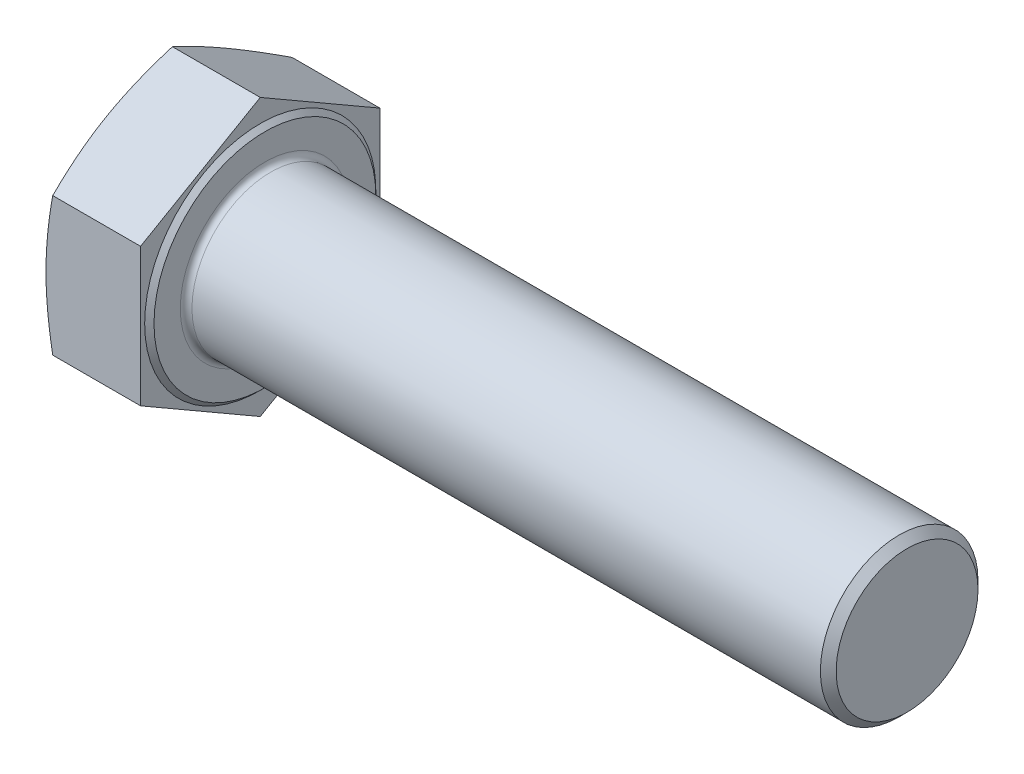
ISO-10303-21;
HEADER;
FILE_DESCRIPTION(('STEP AP214'),'2;1');
FILE_NAME('part.step','',(''),(''),'','','');
FILE_SCHEMA(('AUTOMOTIVE_DESIGN { 1 0 10303 214 1 1 1 1 }'));
ENDSEC;
DATA;
#1=APPLICATION_CONTEXT('core data for automotive mechanical design processes');
#2=APPLICATION_PROTOCOL_DEFINITION('international standard','automotive_design',2000,#1);
#3=PRODUCT_CONTEXT('',#1,'mechanical');
#4=PRODUCT('Part','Part','',(#3));
#5=PRODUCT_RELATED_PRODUCT_CATEGORY('part','',(#4));
#6=PRODUCT_DEFINITION_FORMATION('','',#4);
#7=PRODUCT_DEFINITION_CONTEXT('part definition',#1,'design');
#8=PRODUCT_DEFINITION('design','',#6,#7);
#9=PRODUCT_DEFINITION_SHAPE('','',#8);
#10=(LENGTH_UNIT() NAMED_UNIT(*) SI_UNIT(.MILLI.,.METRE.));
#11=(NAMED_UNIT(*) PLANE_ANGLE_UNIT() SI_UNIT($,.RADIAN.));
#12=(NAMED_UNIT(*) SI_UNIT($,.STERADIAN.) SOLID_ANGLE_UNIT());
#13=UNCERTAINTY_MEASURE_WITH_UNIT(LENGTH_MEASURE(1.E-05),#10,'distance_accuracy_value','');
#14=(GEOMETRIC_REPRESENTATION_CONTEXT(3) GLOBAL_UNCERTAINTY_ASSIGNED_CONTEXT((#13)) GLOBAL_UNIT_ASSIGNED_CONTEXT((#10,
#11,#12)) REPRESENTATION_CONTEXT('',''));
#15=CARTESIAN_POINT('',(0.,0.,0.));
#16=DIRECTION('',(0.,0.,1.));
#17=DIRECTION('',(1.,0.,0.));
#18=AXIS2_PLACEMENT_3D('',#15,#16,#17);
#19=CARTESIAN_POINT('',(17.,0.,41.));
#20=DIRECTION('',(-1.,0.,0.));
#21=DIRECTION('',(0.,0.,1.));
#22=AXIS2_PLACEMENT_3D('',#19,#20,#21);
#23=PLANE('',#22);
#24=CARTESIAN_POINT('',(17.,0.,0.));
#25=DIRECTION('',(-1.,0.,0.));
#26=DIRECTION('',(0.,0.,1.));
#27=AXIS2_PLACEMENT_3D('',#24,#25,#26);
#28=CIRCLE('',#27,14.5);
#29=CARTESIAN_POINT('',(17.,0.,14.5));
#30=VERTEX_POINT('',#29);
#31=EDGE_CURVE('E11',#30,#30,#28,.T.);
#32=ORIENTED_EDGE('',*,*,#31,.T.);
#33=EDGE_LOOP('',(#32));
#34=FACE_BOUND('',#33,.T.);
#35=CARTESIAN_POINT('',(17.,0.,0.));
#36=DIRECTION('',(-1.,0.,0.));
#37=DIRECTION('',(0.,0.,1.));
#38=AXIS2_PLACEMENT_3D('',#35,#36,#37);
#39=CIRCLE('',#38,19.);
#40=CARTESIAN_POINT('',(17.,0.,19.));
#41=VERTEX_POINT('',#40);
#42=EDGE_CURVE('E265',#41,#41,#39,.T.);
#43=ORIENTED_EDGE('',*,*,#42,.F.);
#44=EDGE_LOOP('',(#43));
#45=FACE_BOUND('',#44,.T.);
#46=ADVANCED_FACE('F32',(#34,#45),#23,.F.);
#47=CARTESIAN_POINT('',(17.,-11.8356805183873,20.5));
#48=DIRECTION('',(0.,0.866025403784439,-0.5));
#49=DIRECTION('',(0.,0.5,0.866025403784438));
#50=AXIS2_PLACEMENT_3D('',#47,#48,#49);
#51=PLANE('',#50);
#52=CARTESIAN_POINT('',(1.15432304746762,-23.6714765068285,-0.000200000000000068));
#53=CARTESIAN_POINT('',(1.06511686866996,-23.4263666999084,0.424342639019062));
#54=CARTESIAN_POINT('',(0.979922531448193,-23.1808966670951,0.849509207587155));
#55=CARTESIAN_POINT('',(0.818440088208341,-22.6892027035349,1.70114813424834));
#56=CARTESIAN_POINT('',(0.742152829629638,-22.4429787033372,2.12762061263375));
#57=CARTESIAN_POINT('',(0.527901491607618,-21.7028546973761,3.40955299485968));
#58=CARTESIAN_POINT('',(0.404673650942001,-21.2078415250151,4.26694095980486));
#59=CARTESIAN_POINT('',(0.25491226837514,-20.4659429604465,5.55194696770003));
#60=CARTESIAN_POINT('',(0.210965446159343,-20.2199135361,5.97808243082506));
#61=CARTESIAN_POINT('',(0.135072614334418,-19.7273953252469,6.83114899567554));
#62=CARTESIAN_POINT('',(0.103126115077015,-19.4809065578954,7.25808006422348));
#63=CARTESIAN_POINT('',(0.0517919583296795,-18.9876863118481,8.11236258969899));
#64=CARTESIAN_POINT('',(0.0324000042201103,-18.7409549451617,8.53971385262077));
#65=CARTESIAN_POINT('',(0.00650404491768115,-18.2473226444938,9.3947100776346));
#66=CARTESIAN_POINT('',(0.,-18.0004217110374,9.8223550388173));
#67=CARTESIAN_POINT('',(0.,-17.5066198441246,10.6776449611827));
#68=CARTESIAN_POINT('',(0.00650404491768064,-17.2597189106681,11.1052899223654));
#69=CARTESIAN_POINT('',(0.0324000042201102,-16.7660866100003,11.9602861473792));
#70=CARTESIAN_POINT('',(0.0517919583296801,-16.5193552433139,12.387637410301));
#71=CARTESIAN_POINT('',(0.103126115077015,-16.0261349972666,13.2419199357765));
#72=CARTESIAN_POINT('',(0.135072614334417,-15.779646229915,13.6688510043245));
#73=CARTESIAN_POINT('',(0.210965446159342,-15.2871280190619,14.5219175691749));
#74=CARTESIAN_POINT('',(0.25491226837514,-15.0410985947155,14.9480530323));
#75=CARTESIAN_POINT('',(0.404673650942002,-14.2992000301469,16.2330590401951));
#76=CARTESIAN_POINT('',(0.527901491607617,-13.8041868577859,17.0904470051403));
#77=CARTESIAN_POINT('',(0.742152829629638,-13.0640628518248,18.3723793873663));
#78=CARTESIAN_POINT('',(0.81844008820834,-12.817838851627,18.7988518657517));
#79=CARTESIAN_POINT('',(0.979922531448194,-12.3261448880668,19.6504907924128));
#80=CARTESIAN_POINT('',(1.06511686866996,-12.0806748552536,20.0756573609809));
#81=CARTESIAN_POINT('',(1.15432304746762,-11.8355650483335,20.5002));
#82=B_SPLINE_CURVE_WITH_KNOTS('',3,(#52,#53,#54,#55,#56,#57,#58,#59,#60,#61,#62,#63,#64,#65,#66,
#67,#68,#69,#70,#71,#72,#73,#74,#75,#76,#77,#78,#79,#80,#81),.UNSPECIFIED.,.F.,.F.,(4,2,2,2,2,2,
2,2,2,2,2,2,2,2,4),(0.,1.49476565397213,2.98967340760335,5.98155544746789,7.46349089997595,
8.94536587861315,10.4267334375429,11.9080964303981,13.3894594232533,14.8708269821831,
16.3527019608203,17.8346374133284,20.8265194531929,22.3214272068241,23.8161928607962),.UNSPECIFIED.);
#83=CARTESIAN_POINT('',(1.15428101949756,-23.6713610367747,0.));
#84=VERTEX_POINT('',#83);
#85=CARTESIAN_POINT('',(0.,-17.753520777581,10.25));
#86=VERTEX_POINT('',#85);
#87=EDGE_CURVE('E279',#84,#86,#82,.T.);
#88=ORIENTED_EDGE('',*,*,#87,.F.);
#89=DIRECTION('',(-1.,0.,0.));
#90=VECTOR('',#89,1.);
#91=CARTESIAN_POINT('',(17.,-23.6713610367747,0.));
#92=LINE('',#91,#90);
#93=CARTESIAN_POINT('',(16.2,-23.6713610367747,0.));
#94=VERTEX_POINT('',#93);
#95=EDGE_CURVE('E144',#94,#84,#92,.T.);
#96=ORIENTED_EDGE('',*,*,#95,.F.);
#97=DIRECTION('',(0.,-0.5,-0.866025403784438));
#98=VECTOR('',#97,1.);
#99=CARTESIAN_POINT('',(16.2,-11.8356805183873,20.5));
#100=LINE('',#99,#98);
#101=CARTESIAN_POINT('',(16.2,-11.8356805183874,20.5));
#102=VERTEX_POINT('',#101);
#103=EDGE_CURVE('E135',#102,#94,#100,.T.);
#104=ORIENTED_EDGE('',*,*,#103,.F.);
#105=DIRECTION('',(-1.,0.,0.));
#106=VECTOR('',#105,1.);
#107=CARTESIAN_POINT('',(17.,-11.8356805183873,20.5));
#108=LINE('',#107,#106);
#109=CARTESIAN_POINT('',(1.15428101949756,-11.8356805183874,20.5));
#110=VERTEX_POINT('',#109);
#111=EDGE_CURVE('E130',#102,#110,#108,.T.);
#112=ORIENTED_EDGE('',*,*,#111,.T.);
#113=EDGE_CURVE('E124',#86,#110,#82,.T.);
#114=ORIENTED_EDGE('',*,*,#113,.F.);
#115=EDGE_LOOP('',(#88,#96,#104,#112,#114));
#116=FACE_BOUND('',#115,.T.);
#117=ADVANCED_FACE('F34',(#116),#51,.F.);
#118=CARTESIAN_POINT('',(17.,-23.6713610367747,0.));
#119=DIRECTION('',(0.,0.866025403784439,0.5));
#120=DIRECTION('',(0.,-0.5,0.866025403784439));
#121=AXIS2_PLACEMENT_3D('',#118,#119,#120);
#122=PLANE('',#121);
#123=CARTESIAN_POINT('',(1.15432304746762,-11.8355650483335,-20.5002));
#124=CARTESIAN_POINT('',(1.06511686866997,-12.0806748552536,-20.0756573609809));
#125=CARTESIAN_POINT('',(0.979922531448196,-12.3261448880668,-19.6504907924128));
#126=CARTESIAN_POINT('',(0.818440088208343,-12.817838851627,-18.7988518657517));
#127=CARTESIAN_POINT('',(0.74215282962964,-13.0640628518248,-18.3723793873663));
#128=CARTESIAN_POINT('',(0.527901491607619,-13.8041868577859,-17.0904470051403));
#129=CARTESIAN_POINT('',(0.404673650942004,-14.2992000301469,-16.2330590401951));
#130=CARTESIAN_POINT('',(0.254912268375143,-15.0410985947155,-14.9480530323));
#131=CARTESIAN_POINT('',(0.210965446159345,-15.287128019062,-14.5219175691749));
#132=CARTESIAN_POINT('',(0.13507261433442,-15.7796462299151,-13.6688510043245));
#133=CARTESIAN_POINT('',(0.103126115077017,-16.0261349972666,-13.2419199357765));
#134=CARTESIAN_POINT('',(0.0517919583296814,-16.5193552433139,-12.387637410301));
#135=CARTESIAN_POINT('',(0.0324000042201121,-16.7660866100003,-11.9602861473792));
#136=CARTESIAN_POINT('',(0.00650404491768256,-17.2597189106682,-11.1052899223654));
#137=CARTESIAN_POINT('',(0.,-17.5066198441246,-10.6776449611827));
#138=CARTESIAN_POINT('',(0.,-18.0004217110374,-9.8223550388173));
#139=CARTESIAN_POINT('',(0.00650404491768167,-18.2473226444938,-9.39471007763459));
#140=CARTESIAN_POINT('',(0.0324000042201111,-18.7409549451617,-8.53971385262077));
#141=CARTESIAN_POINT('',(0.0517919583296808,-18.9876863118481,-8.11236258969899));
#142=CARTESIAN_POINT('',(0.103126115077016,-19.4809065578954,-7.25808006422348));
#143=CARTESIAN_POINT('',(0.135072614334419,-19.7273953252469,-6.83114899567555));
#144=CARTESIAN_POINT('',(0.210965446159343,-20.2199135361,-5.97808243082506));
#145=CARTESIAN_POINT('',(0.254912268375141,-20.4659429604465,-5.55194696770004));
#146=CARTESIAN_POINT('',(0.404673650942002,-21.2078415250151,-4.26694095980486));
#147=CARTESIAN_POINT('',(0.527901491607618,-21.7028546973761,-3.40955299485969));
#148=CARTESIAN_POINT('',(0.742152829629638,-22.4429787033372,-2.12762061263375));
#149=CARTESIAN_POINT('',(0.818440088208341,-22.6892027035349,-1.70114813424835));
#150=CARTESIAN_POINT('',(0.979922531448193,-23.1808966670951,-0.849509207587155));
#151=CARTESIAN_POINT('',(1.06511686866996,-23.4263666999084,-0.424342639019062));
#152=CARTESIAN_POINT('',(1.15432304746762,-23.6714765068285,0.000199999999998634));
#153=B_SPLINE_CURVE_WITH_KNOTS('',3,(#123,#124,#125,#126,#127,#128,#129,#130,#131,#132,#133,
#134,#135,#136,#137,#138,#139,#140,#141,#142,#143,#144,#145,#146,#147,#148,#149,#150,#151,#152),
.UNSPECIFIED.,.F.,.F.,(4,2,2,2,2,2,2,2,2,2,2,2,2,2,4),(0.,1.49476565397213,2.98967340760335,
5.98155544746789,7.46349089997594,8.94536587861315,10.4267334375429,11.9080964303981,
13.3894594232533,14.8708269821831,16.3527019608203,17.8346374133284,20.8265194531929,
22.3214272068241,23.8161928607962),.UNSPECIFIED.);
#154=CARTESIAN_POINT('',(1.15428101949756,-11.8356805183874,-20.5));
#155=VERTEX_POINT('',#154);
#156=CARTESIAN_POINT('',(0.,-17.753520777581,-10.25));
#157=VERTEX_POINT('',#156);
#158=EDGE_CURVE('E231',#155,#157,#153,.T.);
#159=ORIENTED_EDGE('',*,*,#158,.F.);
#160=DIRECTION('',(-1.,0.,0.));
#161=VECTOR('',#160,1.);
#162=CARTESIAN_POINT('',(17.,-11.8356805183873,-20.5));
#163=LINE('',#162,#161);
#164=CARTESIAN_POINT('',(16.2,-11.8356805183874,-20.5));
#165=VERTEX_POINT('',#164);
#166=EDGE_CURVE('E141',#165,#155,#163,.T.);
#167=ORIENTED_EDGE('',*,*,#166,.F.);
#168=DIRECTION('',(0.,0.5,-0.866025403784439));
#169=VECTOR('',#168,1.);
#170=CARTESIAN_POINT('',(16.2,-23.6713610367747,0.));
#171=LINE('',#170,#169);
#172=EDGE_CURVE('E269',#94,#165,#171,.T.);
#173=ORIENTED_EDGE('',*,*,#172,.F.);
#174=ORIENTED_EDGE('',*,*,#95,.T.);
#175=EDGE_CURVE('E227',#157,#84,#153,.T.);
#176=ORIENTED_EDGE('',*,*,#175,.F.);
#177=EDGE_LOOP('',(#159,#167,#173,#174,#176));
#178=FACE_BOUND('',#177,.T.);
#179=ADVANCED_FACE('F180',(#178),#122,.F.);
#180=CARTESIAN_POINT('',(17.,-11.8356805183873,-20.5));
#181=DIRECTION('',(0.,0.,1.));
#182=DIRECTION('',(1.,0.,0.));
#183=AXIS2_PLACEMENT_3D('',#180,#181,#182);
#184=PLANE('',#183);
#185=CARTESIAN_POINT('',(6.16802000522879,-31.3367203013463,-20.5));
#186=CARTESIAN_POINT('',(6.02677468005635,-30.8729800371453,-20.5));
#187=CARTESIAN_POINT('',(5.88638353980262,-30.4089797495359,-20.5));
#188=CARTESIAN_POINT('',(5.60750085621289,-29.4804058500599,-20.5));
#189=CARTESIAN_POINT('',(5.46900932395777,-29.0158322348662,-20.5));
#190=CARTESIAN_POINT('',(5.05665312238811,-27.6211108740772,-20.5));
#191=CARTESIAN_POINT('',(4.78592778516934,-26.6900311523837,-20.5));
#192=CARTESIAN_POINT('',(4.25428153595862,-24.8231913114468,-20.5));
#193=CARTESIAN_POINT('',(3.99337985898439,-23.8874257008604,-20.5));
#194=CARTESIAN_POINT('',(3.48441302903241,-22.012414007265,-20.5));
#195=CARTESIAN_POINT('',(3.23634764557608,-21.0731679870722,-20.5));
#196=CARTESIAN_POINT('',(2.75919939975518,-19.2021753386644,-20.5));
#197=CARTESIAN_POINT('',(2.52992020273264,-18.2704790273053,-20.5));
#198=CARTESIAN_POINT('',(2.09088187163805,-16.4024501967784,-20.5));
#199=CARTESIAN_POINT('',(1.88112306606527,-15.466117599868,-20.5));
#200=CARTESIAN_POINT('',(1.48601627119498,-13.5886066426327,-20.5));
#201=CARTESIAN_POINT('',(1.30065995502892,-12.6474300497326,-20.5));
#202=CARTESIAN_POINT('',(0.960002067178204,-10.7596126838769,-20.5));
#203=CARTESIAN_POINT('',(0.804699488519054,-9.81297209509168,-20.5));
#204=CARTESIAN_POINT('',(0.545835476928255,-8.02082218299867,-20.5));
#205=CARTESIAN_POINT('',(0.438425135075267,-7.17587403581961,-20.5));
#206=CARTESIAN_POINT('',(0.256605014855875,-5.48240488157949,-20.5));
#207=CARTESIAN_POINT('',(0.182194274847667,-4.63388397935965,-20.5));
#208=CARTESIAN_POINT('',(0.0699568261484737,-2.93499042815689,-20.5));
#209=CARTESIAN_POINT('',(0.0321042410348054,-2.08461951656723,-20.5));
#210=CARTESIAN_POINT('',(-0.00510042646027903,-0.383026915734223,-20.5));
#211=CARTESIAN_POINT('',(-0.00445278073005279,0.468194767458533,-20.5));
#212=CARTESIAN_POINT('',(0.0354086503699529,2.17403898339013,-20.5));
#213=CARTESIAN_POINT('',(0.0748180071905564,3.02865687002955,-20.5));
#214=CARTESIAN_POINT('',(0.190389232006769,4.73538241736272,-20.5));
#215=CARTESIAN_POINT('',(0.266551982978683,5.58749001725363,-20.5));
#216=CARTESIAN_POINT('',(0.452067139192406,7.28877423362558,-20.5));
#217=CARTESIAN_POINT('',(0.561448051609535,8.13794769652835,-20.5));
#218=CARTESIAN_POINT('',(0.80896274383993,9.83204641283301,-20.5));
#219=CARTESIAN_POINT('',(0.947096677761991,10.6769716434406,-20.5));
#220=CARTESIAN_POINT('',(1.25557044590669,12.4070352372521,-20.5));
#221=CARTESIAN_POINT('',(1.42722732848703,13.2919366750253,-20.5));
#222=CARTESIAN_POINT('',(1.79263434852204,15.0571953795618,-20.5));
#223=CARTESIAN_POINT('',(1.98638615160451,15.9375522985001,-20.5));
#224=CARTESIAN_POINT('',(2.39191462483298,17.6943492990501,-20.5));
#225=CARTESIAN_POINT('',(2.60369652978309,18.5707881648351,-20.5));
#226=CARTESIAN_POINT('',(3.04184013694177,20.319973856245,-20.5));
#227=CARTESIAN_POINT('',(3.26820148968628,21.1927207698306,-20.5));
#228=CARTESIAN_POINT('',(3.73307707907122,22.9361609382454,-20.5));
#229=CARTESIAN_POINT('',(3.97160654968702,23.8068501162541,-20.5));
#230=CARTESIAN_POINT('',(4.45836861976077,25.545508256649,-20.5));
#231=CARTESIAN_POINT('',(4.70660126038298,26.4134772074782,-20.5));
#232=CARTESIAN_POINT('',(5.21099367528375,28.1469457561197,-20.5));
#233=CARTESIAN_POINT('',(5.46715211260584,29.0124457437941,-20.5));
#234=CARTESIAN_POINT('',(5.98605867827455,30.741462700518,-20.5));
#235=CARTESIAN_POINT('',(6.24880679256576,31.6049796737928,-20.5));
#236=CARTESIAN_POINT('',(6.77686389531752,33.320796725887,-20.5));
#237=CARTESIAN_POINT('',(7.04211258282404,34.1731153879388,-20.5));
#238=CARTESIAN_POINT('',(7.57712825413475,35.8763320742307,-20.5));
#239=CARTESIAN_POINT('',(7.84689523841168,36.7272300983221,-20.5));
#240=CARTESIAN_POINT('',(8.39026893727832,38.4278412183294,-20.5));
#241=CARTESIAN_POINT('',(8.6638758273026,39.277554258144,-20.5));
#242=CARTESIAN_POINT('',(9.21435440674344,40.9759223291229,-20.5));
#243=CARTESIAN_POINT('',(9.49122609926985,41.8245773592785,-20.5));
#244=CARTESIAN_POINT('',(10.0467154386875,43.5177478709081,-20.5));
#245=CARTESIAN_POINT('',(10.3253224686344,44.3622668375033,-20.5));
#246=CARTESIAN_POINT('',(10.8849406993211,46.0505080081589,-20.5));
#247=CARTESIAN_POINT('',(11.1659519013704,46.894230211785,-20.5));
#248=CARTESIAN_POINT('',(11.7300385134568,48.5809071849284,-20.5));
#249=CARTESIAN_POINT('',(12.0131137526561,49.4238620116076,-20.5));
#250=CARTESIAN_POINT('',(12.5810959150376,51.1091521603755,-20.5));
#251=CARTESIAN_POINT('',(12.8660028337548,51.9514874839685,-20.5));
#252=CARTESIAN_POINT('',(13.1516986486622,52.7935545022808,-20.5));
#253=B_SPLINE_CURVE_WITH_KNOTS('',3,(#185,#186,#187,#188,#189,#190,#191,#192,#193,#194,#195,
#196,#197,#198,#199,#200,#201,#202,#203,#204,#205,#206,#207,#208,#209,#210,#211,#212,#213,#214,
#215,#216,#217,#218,#219,#220,#221,#222,#223,#224,#225,#226,#227,#228,#229,#230,#231,#232,#233,
#234,#235,#236,#237,#238,#239,#240,#241,#242,#243,#244,#245,#246,#247,#248,#249,#250,#251,#252),
.UNSPECIFIED.,.F.,.F.,(4,2,2,2,2,2,2,2,2,2,2,2,2,2,2,2,2,2,2,2,2,2,2,2,2,2,2,2,2,2,2,2,2,4),(0.,
1.45431873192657,2.90864594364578,5.81751535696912,8.7318119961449,11.6460562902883,
14.5243694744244,17.4027310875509,20.2801079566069,23.1573884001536,25.7120708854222,
28.2666789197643,30.819477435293,33.3722579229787,35.9379848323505,38.5037733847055,
41.0717700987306,43.6397805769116,46.3436259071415,49.0476752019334,51.7525122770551,
54.4572845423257,57.1655304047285,59.8737877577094,62.5815907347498,65.2893879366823,
67.9672895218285,70.6451913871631,73.3232159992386,76.0012431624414,78.6691047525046,
81.3369677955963,84.0046124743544,86.6722506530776),.UNSPECIFIED.);
#254=CARTESIAN_POINT('',(1.15428101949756,11.8356805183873,-20.5));
#255=VERTEX_POINT('',#254);
#256=CARTESIAN_POINT('',(0.,0.,-20.5));
#257=VERTEX_POINT('',#256);
#258=EDGE_CURVE('E304',#255,#257,#253,.F.);
#259=ORIENTED_EDGE('',*,*,#258,.F.);
#260=DIRECTION('',(-1.,0.,0.));
#261=VECTOR('',#260,1.);
#262=CARTESIAN_POINT('',(17.,11.8356805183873,-20.5));
#263=LINE('',#262,#261);
#264=CARTESIAN_POINT('',(16.2,11.8356805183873,-20.5));
#265=VERTEX_POINT('',#264);
#266=EDGE_CURVE('E132',#265,#255,#263,.T.);
#267=ORIENTED_EDGE('',*,*,#266,.F.);
#268=DIRECTION('',(0.,1.,0.));
#269=VECTOR('',#268,1.);
#270=CARTESIAN_POINT('',(16.2,-11.8356805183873,-20.5));
#271=LINE('',#270,#269);
#272=EDGE_CURVE('E262',#165,#265,#271,.T.);
#273=ORIENTED_EDGE('',*,*,#272,.F.);
#274=ORIENTED_EDGE('',*,*,#166,.T.);
#275=EDGE_CURVE('E232',#257,#155,#253,.F.);
#276=ORIENTED_EDGE('',*,*,#275,.F.);
#277=EDGE_LOOP('',(#259,#267,#273,#274,#276));
#278=FACE_BOUND('',#277,.T.);
#279=ADVANCED_FACE('F240',(#278),#184,.F.);
#280=CARTESIAN_POINT('',(17.,11.8356805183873,-20.5));
#281=DIRECTION('',(0.,-0.866025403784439,0.5));
#282=DIRECTION('',(0.,-0.5,-0.866025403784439));
#283=AXIS2_PLACEMENT_3D('',#280,#281,#282);
#284=PLANE('',#283);
#285=CARTESIAN_POINT('',(1.15432304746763,23.6714765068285,0.000199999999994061));
#286=CARTESIAN_POINT('',(1.06511686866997,23.4263666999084,-0.424342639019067));
#287=CARTESIAN_POINT('',(0.979922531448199,23.1808966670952,-0.849509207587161));
#288=CARTESIAN_POINT('',(0.818440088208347,22.689202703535,-1.70114813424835));
#289=CARTESIAN_POINT('',(0.742152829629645,22.4429787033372,-2.12762061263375));
#290=CARTESIAN_POINT('',(0.527901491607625,21.7028546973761,-3.40955299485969));
#291=CARTESIAN_POINT('',(0.404673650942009,21.2078415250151,-4.26694095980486));
#292=CARTESIAN_POINT('',(0.254912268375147,20.4659429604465,-5.55194696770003));
#293=CARTESIAN_POINT('',(0.210965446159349,20.2199135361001,-5.97808243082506));
#294=CARTESIAN_POINT('',(0.135072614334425,19.727395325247,-6.83114899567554));
#295=CARTESIAN_POINT('',(0.103126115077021,19.4809065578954,-7.25808006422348));
#296=CARTESIAN_POINT('',(0.0517919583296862,18.9876863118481,-8.11236258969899));
#297=CARTESIAN_POINT('',(0.0324000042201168,18.7409549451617,-8.53971385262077));
#298=CARTESIAN_POINT('',(0.00650404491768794,18.2473226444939,-9.3947100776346));
#299=CARTESIAN_POINT('',(0.,18.0004217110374,-9.8223550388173));
#300=CARTESIAN_POINT('',(0.,17.5066198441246,-10.6776449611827));
#301=CARTESIAN_POINT('',(0.00650404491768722,17.2597189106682,-11.1052899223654));
#302=CARTESIAN_POINT('',(0.0324000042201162,16.7660866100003,-11.9602861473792));
#303=CARTESIAN_POINT('',(0.0517919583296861,16.5193552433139,-12.387637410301));
#304=CARTESIAN_POINT('',(0.103126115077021,16.0261349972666,-13.2419199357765));
#305=CARTESIAN_POINT('',(0.135072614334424,15.7796462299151,-13.6688510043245));
#306=CARTESIAN_POINT('',(0.210965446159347,15.287128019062,-14.5219175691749));
#307=CARTESIAN_POINT('',(0.254912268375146,15.0410985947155,-14.9480530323));
#308=CARTESIAN_POINT('',(0.404673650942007,14.2992000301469,-16.2330590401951));
#309=CARTESIAN_POINT('',(0.527901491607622,13.8041868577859,-17.0904470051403));
#310=CARTESIAN_POINT('',(0.742152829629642,13.0640628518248,-18.3723793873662));
#311=CARTESIAN_POINT('',(0.818440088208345,12.8178388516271,-18.7988518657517));
#312=CARTESIAN_POINT('',(0.979922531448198,12.3261448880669,-19.6504907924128));
#313=CARTESIAN_POINT('',(1.06511686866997,12.0806748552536,-20.0756573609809));
#314=CARTESIAN_POINT('',(1.15432304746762,11.8355650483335,-20.5002));
#315=B_SPLINE_CURVE_WITH_KNOTS('',3,(#285,#286,#287,#288,#289,#290,#291,#292,#293,#294,#295,
#296,#297,#298,#299,#300,#301,#302,#303,#304,#305,#306,#307,#308,#309,#310,#311,#312,#313,#314),
.UNSPECIFIED.,.F.,.F.,(4,2,2,2,2,2,2,2,2,2,2,2,2,2,4),(0.,1.49476565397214,2.98967340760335,
5.98155544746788,7.46349089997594,8.94536587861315,10.4267334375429,11.9080964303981,
13.3894594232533,14.8708269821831,16.3527019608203,17.8346374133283,20.8265194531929,
22.3214272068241,23.8161928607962),.UNSPECIFIED.);
#316=CARTESIAN_POINT('',(1.15428101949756,23.6713610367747,0.));
#317=VERTEX_POINT('',#316);
#318=CARTESIAN_POINT('',(0.,17.753520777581,-10.25));
#319=VERTEX_POINT('',#318);
#320=EDGE_CURVE('E222',#317,#319,#315,.T.);
#321=ORIENTED_EDGE('',*,*,#320,.F.);
#322=DIRECTION('',(-1.,0.,0.));
#323=VECTOR('',#322,1.);
#324=CARTESIAN_POINT('',(17.,23.6713610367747,0.));
#325=LINE('',#324,#323);
#326=CARTESIAN_POINT('',(16.2,23.6713610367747,0.));
#327=VERTEX_POINT('',#326);
#328=EDGE_CURVE('E129',#327,#317,#325,.T.);
#329=ORIENTED_EDGE('',*,*,#328,.F.);
#330=DIRECTION('',(0.,0.5,0.866025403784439));
#331=VECTOR('',#330,1.);
#332=CARTESIAN_POINT('',(16.2,11.8356805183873,-20.5));
#333=LINE('',#332,#331);
#334=EDGE_CURVE('E259',#265,#327,#333,.T.);
#335=ORIENTED_EDGE('',*,*,#334,.F.);
#336=ORIENTED_EDGE('',*,*,#266,.T.);
#337=EDGE_CURVE('E256',#319,#255,#315,.T.);
#338=ORIENTED_EDGE('',*,*,#337,.F.);
#339=EDGE_LOOP('',(#321,#329,#335,#336,#338));
#340=FACE_BOUND('',#339,.T.);
#341=ADVANCED_FACE('F244',(#340),#284,.F.);
#342=CARTESIAN_POINT('',(17.,23.6713610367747,0.));
#343=DIRECTION('',(0.,-0.866025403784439,-0.5));
#344=DIRECTION('',(0.,0.5,-0.866025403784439));
#345=AXIS2_PLACEMENT_3D('',#342,#343,#344);
#346=PLANE('',#345);
#347=CARTESIAN_POINT('',(1.15432304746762,11.8355650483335,20.5002));
#348=CARTESIAN_POINT('',(1.06511686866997,12.0806748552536,20.0756573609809));
#349=CARTESIAN_POINT('',(0.979922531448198,12.3261448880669,19.6504907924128));
#350=CARTESIAN_POINT('',(0.818440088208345,12.8178388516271,18.7988518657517));
#351=CARTESIAN_POINT('',(0.742152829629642,13.0640628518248,18.3723793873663));
#352=CARTESIAN_POINT('',(0.527901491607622,13.8041868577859,17.0904470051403));
#353=CARTESIAN_POINT('',(0.404673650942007,14.2992000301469,16.2330590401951));
#354=CARTESIAN_POINT('',(0.254912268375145,15.0410985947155,14.9480530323));
#355=CARTESIAN_POINT('',(0.210965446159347,15.287128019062,14.5219175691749));
#356=CARTESIAN_POINT('',(0.135072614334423,15.7796462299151,13.6688510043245));
#357=CARTESIAN_POINT('',(0.10312611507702,16.0261349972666,13.2419199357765));
#358=CARTESIAN_POINT('',(0.0517919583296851,16.5193552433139,12.387637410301));
#359=CARTESIAN_POINT('',(0.0324000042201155,16.7660866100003,11.9602861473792));
#360=CARTESIAN_POINT('',(0.00650404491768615,17.2597189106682,11.1052899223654));
#361=CARTESIAN_POINT('',(0.,17.5066198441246,10.6776449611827));
#362=CARTESIAN_POINT('',(0.,18.0004217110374,9.82235503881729));
#363=CARTESIAN_POINT('',(0.00650404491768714,18.2473226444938,9.39471007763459));
#364=CARTESIAN_POINT('',(0.0324000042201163,18.7409549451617,8.53971385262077));
#365=CARTESIAN_POINT('',(0.0517919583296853,18.9876863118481,8.11236258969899));
#366=CARTESIAN_POINT('',(0.10312611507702,19.4809065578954,7.25808006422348));
#367=CARTESIAN_POINT('',(0.135072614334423,19.727395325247,6.83114899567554));
#368=CARTESIAN_POINT('',(0.210965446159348,20.2199135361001,5.97808243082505));
#369=CARTESIAN_POINT('',(0.254912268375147,20.4659429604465,5.55194696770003));
#370=CARTESIAN_POINT('',(0.404673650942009,21.2078415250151,4.26694095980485));
#371=CARTESIAN_POINT('',(0.527901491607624,21.7028546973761,3.40955299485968));
#372=CARTESIAN_POINT('',(0.742152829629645,22.4429787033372,2.12762061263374));
#373=CARTESIAN_POINT('',(0.818440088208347,22.689202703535,1.70114813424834));
#374=CARTESIAN_POINT('',(0.9799225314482,23.1808966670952,0.849509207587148));
#375=CARTESIAN_POINT('',(1.06511686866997,23.4263666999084,0.424342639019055));
#376=CARTESIAN_POINT('',(1.15432304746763,23.6714765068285,-0.00020000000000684));
#377=B_SPLINE_CURVE_WITH_KNOTS('',3,(#347,#348,#349,#350,#351,#352,#353,#354,#355,#356,#357,
#358,#359,#360,#361,#362,#363,#364,#365,#366,#367,#368,#369,#370,#371,#372,#373,#374,#375,#376),
.UNSPECIFIED.,.F.,.F.,(4,2,2,2,2,2,2,2,2,2,2,2,2,2,4),(0.,1.49476565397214,2.98967340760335,
5.98155544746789,7.46349089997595,8.94536587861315,10.4267334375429,11.9080964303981,
13.3894594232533,14.8708269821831,16.3527019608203,17.8346374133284,20.8265194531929,
22.3214272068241,23.8161928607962),.UNSPECIFIED.);
#378=CARTESIAN_POINT('',(1.15428101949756,11.8356805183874,20.5));
#379=VERTEX_POINT('',#378);
#380=CARTESIAN_POINT('',(0.,17.753520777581,10.25));
#381=VERTEX_POINT('',#380);
#382=EDGE_CURVE('E109',#379,#381,#377,.T.);
#383=ORIENTED_EDGE('',*,*,#382,.F.);
#384=DIRECTION('',(-1.,0.,0.));
#385=VECTOR('',#384,1.);
#386=CARTESIAN_POINT('',(17.,11.8356805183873,20.5));
#387=LINE('',#386,#385);
#388=CARTESIAN_POINT('',(16.2,11.8356805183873,20.5));
#389=VERTEX_POINT('',#388);
#390=EDGE_CURVE('E121',#389,#379,#387,.T.);
#391=ORIENTED_EDGE('',*,*,#390,.F.);
#392=DIRECTION('',(0.,-0.5,0.866025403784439));
#393=VECTOR('',#392,1.);
#394=CARTESIAN_POINT('',(16.2,23.6713610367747,0.));
#395=LINE('',#394,#393);
#396=EDGE_CURVE('E56',#327,#389,#395,.T.);
#397=ORIENTED_EDGE('',*,*,#396,.F.);
#398=ORIENTED_EDGE('',*,*,#328,.T.);
#399=EDGE_CURVE('E123',#381,#317,#377,.T.);
#400=ORIENTED_EDGE('',*,*,#399,.F.);
#401=EDGE_LOOP('',(#383,#391,#397,#398,#400));
#402=FACE_BOUND('',#401,.T.);
#403=ADVANCED_FACE('F120',(#402),#346,.F.);
#404=CARTESIAN_POINT('',(17.,11.8356805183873,20.5));
#405=DIRECTION('',(0.,0.,-1.));
#406=DIRECTION('',(-1.,0.,0.));
#407=AXIS2_PLACEMENT_3D('',#404,#405,#406);
#408=PLANE('',#407);
#409=CARTESIAN_POINT('',(6.16802000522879,-31.3367203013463,20.5));
#410=CARTESIAN_POINT('',(6.02677468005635,-30.8729800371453,20.5));
#411=CARTESIAN_POINT('',(5.88638353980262,-30.4089797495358,20.5));
#412=CARTESIAN_POINT('',(5.60750085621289,-29.4804058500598,20.5));
#413=CARTESIAN_POINT('',(5.46900932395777,-29.0158322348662,20.5));
#414=CARTESIAN_POINT('',(5.05665312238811,-27.6211108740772,20.5));
#415=CARTESIAN_POINT('',(4.78592778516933,-26.6900311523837,20.5));
#416=CARTESIAN_POINT('',(4.25428153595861,-24.8231913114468,20.5));
#417=CARTESIAN_POINT('',(3.99337985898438,-23.8874257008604,20.5));
#418=CARTESIAN_POINT('',(3.48441302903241,-22.012414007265,20.5));
#419=CARTESIAN_POINT('',(3.23634764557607,-21.0731679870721,20.5));
#420=CARTESIAN_POINT('',(2.75919939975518,-19.2021753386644,20.5));
#421=CARTESIAN_POINT('',(2.52992020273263,-18.2704790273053,20.5));
#422=CARTESIAN_POINT('',(2.09088187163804,-16.4024501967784,20.5));
#423=CARTESIAN_POINT('',(1.88112306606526,-15.466117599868,20.5));
#424=CARTESIAN_POINT('',(1.48601627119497,-13.5886066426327,20.5));
#425=CARTESIAN_POINT('',(1.30065995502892,-12.6474300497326,20.5));
#426=CARTESIAN_POINT('',(0.960002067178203,-10.7596126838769,20.5));
#427=CARTESIAN_POINT('',(0.804699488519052,-9.81297209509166,20.5));
#428=CARTESIAN_POINT('',(0.545835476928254,-8.02082218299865,20.5));
#429=CARTESIAN_POINT('',(0.438425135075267,-7.1758740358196,20.5));
#430=CARTESIAN_POINT('',(0.256605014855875,-5.48240488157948,20.5));
#431=CARTESIAN_POINT('',(0.182194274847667,-4.63388397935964,20.5));
#432=CARTESIAN_POINT('',(0.0699568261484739,-2.93499042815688,20.5));
#433=CARTESIAN_POINT('',(0.0321042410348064,-2.08461951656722,20.5));
#434=CARTESIAN_POINT('',(-0.00510042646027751,-0.383026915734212,20.5));
#435=CARTESIAN_POINT('',(-0.00445278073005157,0.468194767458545,20.5));
#436=CARTESIAN_POINT('',(0.0354086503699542,2.17403898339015,20.5));
#437=CARTESIAN_POINT('',(0.0748180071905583,3.02865687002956,20.5));
#438=CARTESIAN_POINT('',(0.190389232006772,4.73538241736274,20.5));
#439=CARTESIAN_POINT('',(0.266551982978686,5.58749001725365,20.5));
#440=CARTESIAN_POINT('',(0.452067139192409,7.2887742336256,20.5));
#441=CARTESIAN_POINT('',(0.561448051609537,8.13794769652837,20.5));
#442=CARTESIAN_POINT('',(0.808962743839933,9.83204641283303,20.5));
#443=CARTESIAN_POINT('',(0.947096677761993,10.6769716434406,20.5));
#444=CARTESIAN_POINT('',(1.2555704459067,12.4070352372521,20.5));
#445=CARTESIAN_POINT('',(1.42722732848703,13.2919366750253,20.5));
#446=CARTESIAN_POINT('',(1.79263434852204,15.0571953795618,20.5));
#447=CARTESIAN_POINT('',(1.98638615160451,15.9375522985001,20.5));
#448=CARTESIAN_POINT('',(2.39191462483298,17.6943492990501,20.5));
#449=CARTESIAN_POINT('',(2.60369652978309,18.5707881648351,20.5));
#450=CARTESIAN_POINT('',(3.04184013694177,20.319973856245,20.5));
#451=CARTESIAN_POINT('',(3.26820148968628,21.1927207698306,20.5));
#452=CARTESIAN_POINT('',(3.73307707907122,22.9361609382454,20.5));
#453=CARTESIAN_POINT('',(3.97160654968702,23.8068501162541,20.5));
#454=CARTESIAN_POINT('',(4.45836861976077,25.545508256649,20.5));
#455=CARTESIAN_POINT('',(4.70660126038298,26.4134772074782,20.5));
#456=CARTESIAN_POINT('',(5.21099367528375,28.1469457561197,20.5));
#457=CARTESIAN_POINT('',(5.46715211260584,29.0124457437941,20.5));
#458=CARTESIAN_POINT('',(5.98605867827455,30.7414627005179,20.5));
#459=CARTESIAN_POINT('',(6.24880679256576,31.6049796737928,20.5));
#460=CARTESIAN_POINT('',(6.77686389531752,33.320796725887,20.5));
#461=CARTESIAN_POINT('',(7.04211258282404,34.1731153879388,20.5));
#462=CARTESIAN_POINT('',(7.57712825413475,35.8763320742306,20.5));
#463=CARTESIAN_POINT('',(7.84689523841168,36.7272300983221,20.5));
#464=CARTESIAN_POINT('',(8.39026893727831,38.4278412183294,20.5));
#465=CARTESIAN_POINT('',(8.6638758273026,39.277554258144,20.5));
#466=CARTESIAN_POINT('',(9.21435440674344,40.9759223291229,20.5));
#467=CARTESIAN_POINT('',(9.49122609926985,41.8245773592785,20.5));
#468=CARTESIAN_POINT('',(10.0467154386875,43.5177478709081,20.5));
#469=CARTESIAN_POINT('',(10.3253224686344,44.3622668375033,20.5));
#470=CARTESIAN_POINT('',(10.8849406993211,46.0505080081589,20.5));
#471=CARTESIAN_POINT('',(11.1659519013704,46.894230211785,20.5));
#472=CARTESIAN_POINT('',(11.7300385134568,48.5809071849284,20.5));
#473=CARTESIAN_POINT('',(12.0131137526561,49.4238620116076,20.5));
#474=CARTESIAN_POINT('',(12.5810959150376,51.1091521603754,20.5));
#475=CARTESIAN_POINT('',(12.8660028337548,51.9514874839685,20.5));
#476=CARTESIAN_POINT('',(13.1516986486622,52.7935545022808,20.5));
#477=B_SPLINE_CURVE_WITH_KNOTS('',3,(#409,#410,#411,#412,#413,#414,#415,#416,#417,#418,#419,
#420,#421,#422,#423,#424,#425,#426,#427,#428,#429,#430,#431,#432,#433,#434,#435,#436,#437,#438,
#439,#440,#441,#442,#443,#444,#445,#446,#447,#448,#449,#450,#451,#452,#453,#454,#455,#456,#457,
#458,#459,#460,#461,#462,#463,#464,#465,#466,#467,#468,#469,#470,#471,#472,#473,#474,#475,#476),
.UNSPECIFIED.,.F.,.F.,(4,2,2,2,2,2,2,2,2,2,2,2,2,2,2,2,2,2,2,2,2,2,2,2,2,2,2,2,2,2,2,2,2,4),(0.,
1.45431873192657,2.90864594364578,5.81751535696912,8.7318119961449,11.6460562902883,
14.5243694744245,17.4027310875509,20.2801079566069,23.1573884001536,25.7120708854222,
28.2666789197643,30.819477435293,33.3722579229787,35.9379848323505,38.5037733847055,
41.0717700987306,43.6397805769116,46.3436259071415,49.0476752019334,51.7525122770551,
54.4572845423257,57.1655304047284,59.8737877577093,62.5815907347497,65.2893879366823,
67.9672895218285,70.6451913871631,73.3232159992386,76.0012431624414,78.6691047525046,
81.3369677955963,84.0046124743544,86.6722506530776),.UNSPECIFIED.);
#478=CARTESIAN_POINT('',(0.,0.,20.5));
#479=VERTEX_POINT('',#478);
#480=EDGE_CURVE('E115',#110,#479,#477,.T.);
#481=ORIENTED_EDGE('',*,*,#480,.F.);
#482=ORIENTED_EDGE('',*,*,#111,.F.);
#483=DIRECTION('',(0.,-1.,0.));
#484=VECTOR('',#483,1.);
#485=CARTESIAN_POINT('',(16.2,11.8356805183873,20.5));
#486=LINE('',#485,#484);
#487=EDGE_CURVE('E128',#389,#102,#486,.T.);
#488=ORIENTED_EDGE('',*,*,#487,.F.);
#489=ORIENTED_EDGE('',*,*,#390,.T.);
#490=EDGE_CURVE('E106',#479,#379,#477,.T.);
#491=ORIENTED_EDGE('',*,*,#490,.F.);
#492=EDGE_LOOP('',(#481,#482,#488,#489,#491));
#493=FACE_BOUND('',#492,.T.);
#494=ADVANCED_FACE('F126',(#493),#408,.F.);
#495=CARTESIAN_POINT('',(16.2,19.8,0.));
#496=DIRECTION('',(1.,0.,0.));
#497=DIRECTION('',(0.,0.,-1.));
#498=AXIS2_PLACEMENT_3D('',#495,#496,#497);
#499=PLANE('',#498);
#500=CARTESIAN_POINT('',(16.2,0.,0.));
#501=DIRECTION('',(-1.,0.,0.));
#502=DIRECTION('',(0.,0.,1.));
#503=AXIS2_PLACEMENT_3D('',#500,#501,#502);
#504=CIRCLE('',#503,19.8);
#505=CARTESIAN_POINT('',(16.2,0.,19.8));
#506=VERTEX_POINT('',#505);
#507=EDGE_CURVE('E260',#506,#506,#504,.T.);
#508=ORIENTED_EDGE('',*,*,#507,.T.);
#509=EDGE_LOOP('',(#508));
#510=FACE_BOUND('',#509,.T.);
#511=ORIENTED_EDGE('',*,*,#103,.T.);
#512=ORIENTED_EDGE('',*,*,#172,.T.);
#513=ORIENTED_EDGE('',*,*,#272,.T.);
#514=ORIENTED_EDGE('',*,*,#334,.T.);
#515=ORIENTED_EDGE('',*,*,#396,.T.);
#516=ORIENTED_EDGE('',*,*,#487,.T.);
#517=EDGE_LOOP('',(#511,#512,#513,#514,#515,#516));
#518=FACE_BOUND('',#517,.T.);
#519=ADVANCED_FACE('F190',(#510,#518),#499,.T.);
#520=CARTESIAN_POINT('',(16.2,0.,0.));
#521=DIRECTION('',(-1.,0.,0.));
#522=DIRECTION('',(0.,0.,1.));
#523=AXIS2_PLACEMENT_3D('',#520,#521,#522);
#524=CONICAL_SURFACE('',#523,19.8,0.78539816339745);
#525=ORIENTED_EDGE('',*,*,#42,.T.);
#526=EDGE_LOOP('',(#525));
#527=FACE_BOUND('',#526,.T.);
#528=ORIENTED_EDGE('',*,*,#507,.F.);
#529=EDGE_LOOP('',(#528));
#530=FACE_BOUND('',#529,.T.);
#531=ADVANCED_FACE('F211',(#527,#530),#524,.T.);
#532=CARTESIAN_POINT('',(0.,0.,0.));
#533=DIRECTION('',(1.,0.,0.));
#534=DIRECTION('',(0.,0.,-1.));
#535=AXIS2_PLACEMENT_3D('',#532,#533,#534);
#536=CONICAL_SURFACE('',#535,20.5,1.22173047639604);
#537=ORIENTED_EDGE('',*,*,#113,.T.);
#538=ORIENTED_EDGE('',*,*,#480,.T.);
#539=CARTESIAN_POINT('',(0.,0.,0.));
#540=DIRECTION('',(-1.,0.,0.));
#541=DIRECTION('',(0.,0.,1.));
#542=AXIS2_PLACEMENT_3D('',#539,#540,#541);
#543=CIRCLE('',#542,20.5);
#544=EDGE_CURVE('E48',#86,#479,#543,.T.);
#545=ORIENTED_EDGE('',*,*,#544,.F.);
#546=EDGE_LOOP('',(#537,#538,#545));
#547=FACE_BOUND('',#546,.T.);
#548=ADVANCED_FACE('F283',(#547),#536,.T.);
#549=ORIENTED_EDGE('',*,*,#175,.T.);
#550=ORIENTED_EDGE('',*,*,#87,.T.);
#551=EDGE_CURVE('E149',#157,#86,#543,.T.);
#552=ORIENTED_EDGE('',*,*,#551,.F.);
#553=EDGE_LOOP('',(#549,#550,#552));
#554=FACE_BOUND('',#553,.T.);
#555=ADVANCED_FACE('F292',(#554),#536,.T.);
#556=ORIENTED_EDGE('',*,*,#275,.T.);
#557=ORIENTED_EDGE('',*,*,#158,.T.);
#558=EDGE_CURVE('E287',#257,#157,#543,.T.);
#559=ORIENTED_EDGE('',*,*,#558,.F.);
#560=EDGE_LOOP('',(#556,#557,#559));
#561=FACE_BOUND('',#560,.T.);
#562=ADVANCED_FACE('F208',(#561),#536,.T.);
#563=ORIENTED_EDGE('',*,*,#258,.T.);
#564=EDGE_CURVE('E288',#319,#257,#543,.T.);
#565=ORIENTED_EDGE('',*,*,#564,.F.);
#566=ORIENTED_EDGE('',*,*,#337,.T.);
#567=EDGE_LOOP('',(#563,#565,#566));
#568=FACE_BOUND('',#567,.T.);
#569=ADVANCED_FACE('F202',(#568),#536,.T.);
#570=ORIENTED_EDGE('',*,*,#320,.T.);
#571=EDGE_CURVE('E150',#381,#319,#543,.T.);
#572=ORIENTED_EDGE('',*,*,#571,.F.);
#573=ORIENTED_EDGE('',*,*,#399,.T.);
#574=EDGE_LOOP('',(#570,#572,#573));
#575=FACE_BOUND('',#574,.T.);
#576=ADVANCED_FACE('F207',(#575),#536,.T.);
#577=ORIENTED_EDGE('',*,*,#382,.T.);
#578=CARTESIAN_POINT('',(0.,0.,0.));
#579=DIRECTION('',(-1.,0.,0.));
#580=DIRECTION('',(0.,0.,1.));
#581=AXIS2_PLACEMENT_3D('',#578,#579,#580);
#582=CIRCLE('',#581,20.5);
#583=EDGE_CURVE('E111',#479,#381,#582,.T.);
#584=ORIENTED_EDGE('',*,*,#583,.F.);
#585=ORIENTED_EDGE('',*,*,#490,.T.);
#586=EDGE_LOOP('',(#577,#584,#585));
#587=FACE_BOUND('',#586,.T.);
#588=ADVANCED_FACE('F108',(#587),#536,.T.);
#589=CARTESIAN_POINT('',(0.,0.,41.));
#590=DIRECTION('',(-1.,0.,0.));
#591=DIRECTION('',(0.,0.,1.));
#592=AXIS2_PLACEMENT_3D('',#589,#590,#591);
#593=PLANE('',#592);
#594=ORIENTED_EDGE('',*,*,#544,.T.);
#595=ORIENTED_EDGE('',*,*,#583,.T.);
#596=ORIENTED_EDGE('',*,*,#571,.T.);
#597=ORIENTED_EDGE('',*,*,#564,.T.);
#598=ORIENTED_EDGE('',*,*,#558,.T.);
#599=ORIENTED_EDGE('',*,*,#551,.T.);
#600=EDGE_LOOP('',(#594,#595,#596,#597,#598,#599));
#601=FACE_BOUND('',#600,.T.);
#602=ADVANCED_FACE('F185',(#601),#593,.T.);
#603=CARTESIAN_POINT('',(127.,0.,0.));
#604=DIRECTION('',(-1.,0.,0.));
#605=DIRECTION('',(0.,0.,1.));
#606=AXIS2_PLACEMENT_3D('',#603,#604,#605);
#607=CYLINDRICAL_SURFACE('',#606,13.5);
#608=CARTESIAN_POINT('',(18.,0.,0.));
#609=DIRECTION('',(-1.,0.,0.));
#610=DIRECTION('',(0.,0.,1.));
#611=AXIS2_PLACEMENT_3D('',#608,#609,#610);
#612=CIRCLE('',#611,13.5);
#613=CARTESIAN_POINT('',(18.,0.,13.5));
#614=VERTEX_POINT('',#613);
#615=EDGE_CURVE('E41',#614,#614,#612,.F.);
#616=ORIENTED_EDGE('',*,*,#615,.T.);
#617=EDGE_LOOP('',(#616));
#618=FACE_BOUND('',#617,.T.);
#619=CARTESIAN_POINT('',(125.65,0.,0.));
#620=DIRECTION('',(1.,0.,0.));
#621=DIRECTION('',(0.,0.,-1.));
#622=AXIS2_PLACEMENT_3D('',#619,#620,#621);
#623=CIRCLE('',#622,13.5);
#624=CARTESIAN_POINT('',(125.65,0.,-13.5));
#625=VERTEX_POINT('',#624);
#626=EDGE_CURVE('E154',#625,#625,#623,.F.);
#627=ORIENTED_EDGE('',*,*,#626,.T.);
#628=EDGE_LOOP('',(#627));
#629=FACE_BOUND('',#628,.T.);
#630=ADVANCED_FACE('F159',(#618,#629),#607,.T.);
#631=CARTESIAN_POINT('',(127.,0.,0.));
#632=DIRECTION('',(1.,0.,0.));
#633=DIRECTION('',(0.,0.,-1.));
#634=AXIS2_PLACEMENT_3D('',#631,#632,#633);
#635=PLANE('',#634);
#636=CARTESIAN_POINT('',(127.,0.,0.));
#637=DIRECTION('',(1.,0.,0.));
#638=DIRECTION('',(0.,0.,-1.));
#639=AXIS2_PLACEMENT_3D('',#636,#637,#638);
#640=CIRCLE('',#639,12.15);
#641=CARTESIAN_POINT('',(127.,0.,-12.15));
#642=VERTEX_POINT('',#641);
#643=EDGE_CURVE('E151',#642,#642,#640,.T.);
#644=ORIENTED_EDGE('',*,*,#643,.T.);
#645=EDGE_LOOP('',(#644));
#646=FACE_BOUND('',#645,.T.);
#647=ADVANCED_FACE('F170',(#646),#635,.T.);
#648=CARTESIAN_POINT('',(127.,0.,0.));
#649=DIRECTION('',(-1.,0.,0.));
#650=DIRECTION('',(0.,0.,1.));
#651=AXIS2_PLACEMENT_3D('',#648,#649,#650);
#652=CONICAL_SURFACE('',#651,12.15,0.785398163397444);
#653=ORIENTED_EDGE('',*,*,#626,.F.);
#654=EDGE_LOOP('',(#653));
#655=FACE_BOUND('',#654,.T.);
#656=ORIENTED_EDGE('',*,*,#643,.F.);
#657=EDGE_LOOP('',(#656));
#658=FACE_BOUND('',#657,.T.);
#659=ADVANCED_FACE('F164',(#655,#658),#652,.T.);
#660=CARTESIAN_POINT('',(18.,0.,0.));
#661=DIRECTION('',(-1.,0.,0.));
#662=DIRECTION('',(0.,0.,1.));
#663=AXIS2_PLACEMENT_3D('',#660,#661,#662);
#664=TOROIDAL_SURFACE('',#663,14.5,1.);
#665=ORIENTED_EDGE('',*,*,#31,.F.);
#666=EDGE_LOOP('',(#665));
#667=FACE_BOUND('',#666,.T.);
#668=ORIENTED_EDGE('',*,*,#615,.F.);
#669=EDGE_LOOP('',(#668));
#670=FACE_BOUND('',#669,.T.);
#671=ADVANCED_FACE('F162',(#667,#670),#664,.F.);
#672=CLOSED_SHELL('',(#46,#117,#179,#279,#341,#403,#494,#519,#531,#548,#555,#562,#569,#576,#588,
#602,#630,#647,#659,#671));
#673=MANIFOLD_SOLID_BREP('B2',#672);
#674=ADVANCED_BREP_SHAPE_REPRESENTATION('',(#18,#673),#14);
#675=SHAPE_DEFINITION_REPRESENTATION(#9,#674);
ENDSEC;
END-ISO-10303-21;
